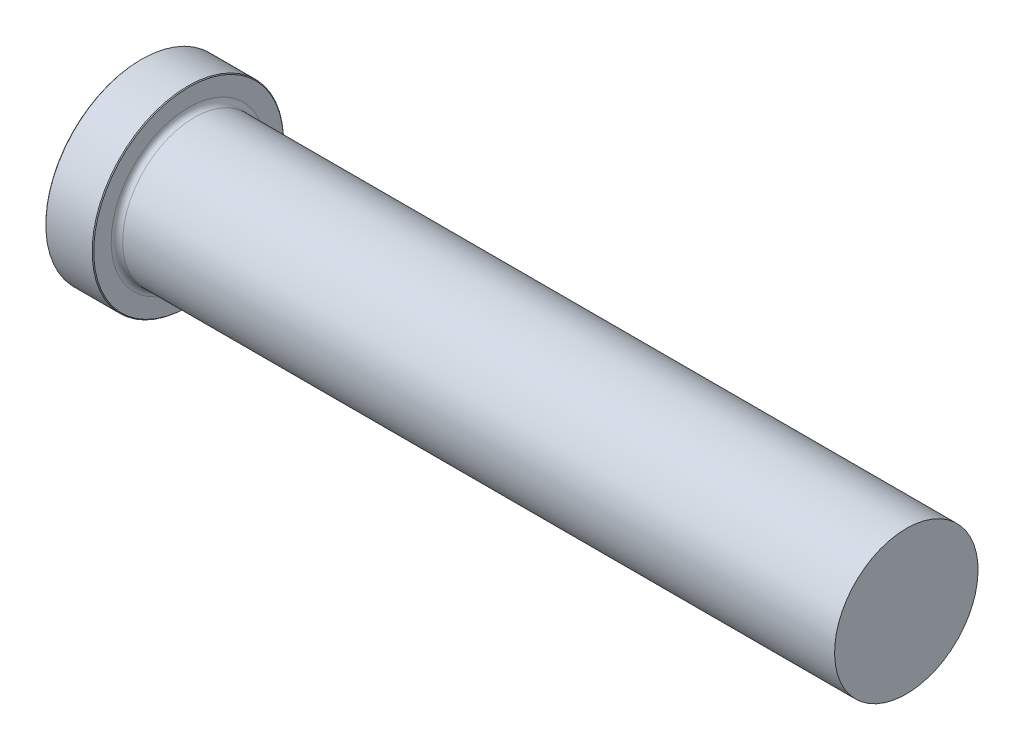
ISO-10303-21;
HEADER;
FILE_DESCRIPTION(('STEP AP214'),'2;1');
FILE_NAME('part.step','',(''),(''),'','','');
FILE_SCHEMA(('AUTOMOTIVE_DESIGN { 1 0 10303 214 1 1 1 1 }'));
ENDSEC;
DATA;
#1=APPLICATION_CONTEXT('core data for automotive mechanical design processes');
#2=APPLICATION_PROTOCOL_DEFINITION('international standard','automotive_design',2000,#1);
#3=PRODUCT_CONTEXT('',#1,'mechanical');
#4=PRODUCT('Part','Part','',(#3));
#5=PRODUCT_RELATED_PRODUCT_CATEGORY('part','',(#4));
#6=PRODUCT_DEFINITION_FORMATION('','',#4);
#7=PRODUCT_DEFINITION_CONTEXT('part definition',#1,'design');
#8=PRODUCT_DEFINITION('design','',#6,#7);
#9=PRODUCT_DEFINITION_SHAPE('','',#8);
#10=(LENGTH_UNIT() NAMED_UNIT(*) SI_UNIT(.MILLI.,.METRE.));
#11=(NAMED_UNIT(*) PLANE_ANGLE_UNIT() SI_UNIT($,.RADIAN.));
#12=(NAMED_UNIT(*) SI_UNIT($,.STERADIAN.) SOLID_ANGLE_UNIT());
#13=UNCERTAINTY_MEASURE_WITH_UNIT(LENGTH_MEASURE(1.E-05),#10,'distance_accuracy_value','');
#14=(GEOMETRIC_REPRESENTATION_CONTEXT(3) GLOBAL_UNCERTAINTY_ASSIGNED_CONTEXT((#13)) GLOBAL_UNIT_ASSIGNED_CONTEXT((#10,
#11,#12)) REPRESENTATION_CONTEXT('',''));
#15=CARTESIAN_POINT('',(0.,0.,0.));
#16=DIRECTION('',(0.,0.,1.));
#17=DIRECTION('',(1.,0.,0.));
#18=AXIS2_PLACEMENT_3D('',#15,#16,#17);
#19=CARTESIAN_POINT('',(101.6,9.51865,0.));
#20=DIRECTION('',(1.,0.,0.));
#21=DIRECTION('',(0.,1.,0.));
#22=AXIS2_PLACEMENT_3D('',#19,#20,#21);
#23=PLANE('',#22);
#24=CARTESIAN_POINT('',(101.6,0.,0.));
#25=DIRECTION('',(1.,0.,0.));
#26=DIRECTION('',(0.,1.,0.));
#27=AXIS2_PLACEMENT_3D('',#24,#25,#26);
#28=CIRCLE('',#27,9.51865);
#29=CARTESIAN_POINT('',(101.6,9.51865,0.));
#30=VERTEX_POINT('',#29);
#31=EDGE_CURVE('E50',#30,#30,#28,.T.);
#32=ORIENTED_EDGE('',*,*,#31,.T.);
#33=EDGE_LOOP('',(#32));
#34=FACE_BOUND('',#33,.T.);
#35=ADVANCED_FACE('F30',(#34),#23,.T.);
#36=CARTESIAN_POINT('',(101.6,0.,0.));
#37=DIRECTION('',(1.,0.,0.));
#38=DIRECTION('',(0.,1.,0.));
#39=AXIS2_PLACEMENT_3D('',#36,#37,#38);
#40=CYLINDRICAL_SURFACE('',#39,9.51865);
#41=CARTESIAN_POINT('',(7.11199999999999,0.,0.));
#42=DIRECTION('',(1.,0.,0.));
#43=DIRECTION('',(0.,1.,0.));
#44=AXIS2_PLACEMENT_3D('',#41,#42,#43);
#45=CIRCLE('',#44,9.51865);
#46=CARTESIAN_POINT('',(7.11199999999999,9.51865,0.));
#47=VERTEX_POINT('',#46);
#48=EDGE_CURVE('E53',#47,#47,#45,.T.);
#49=ORIENTED_EDGE('',*,*,#48,.T.);
#50=EDGE_LOOP('',(#49));
#51=FACE_BOUND('',#50,.T.);
#52=ORIENTED_EDGE('',*,*,#31,.F.);
#53=EDGE_LOOP('',(#52));
#54=FACE_BOUND('',#53,.T.);
#55=ADVANCED_FACE('F74',(#51,#54),#40,.T.);
#56=CARTESIAN_POINT('',(7.112,0.,0.));
#57=DIRECTION('',(1.,0.,0.));
#58=DIRECTION('',(0.,1.,0.));
#59=AXIS2_PLACEMENT_3D('',#56,#57,#58);
#60=TOROIDAL_SURFACE('',#59,10.28065,0.762);
#61=CARTESIAN_POINT('',(6.34999999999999,0.,0.));
#62=DIRECTION('',(1.,0.,0.));
#63=DIRECTION('',(0.,1.,0.));
#64=AXIS2_PLACEMENT_3D('',#61,#62,#63);
#65=CIRCLE('',#64,10.28065);
#66=CARTESIAN_POINT('',(6.35,10.28065,0.));
#67=VERTEX_POINT('',#66);
#68=EDGE_CURVE('E56',#67,#67,#65,.T.);
#69=ORIENTED_EDGE('',*,*,#68,.T.);
#70=EDGE_LOOP('',(#69));
#71=FACE_BOUND('',#70,.T.);
#72=ORIENTED_EDGE('',*,*,#48,.F.);
#73=EDGE_LOOP('',(#72));
#74=FACE_BOUND('',#73,.T.);
#75=ADVANCED_FACE('F60',(#71,#74),#60,.F.);
#76=CARTESIAN_POINT('',(6.35,12.7,0.));
#77=DIRECTION('',(1.,0.,0.));
#78=DIRECTION('',(0.,1.,0.));
#79=AXIS2_PLACEMENT_3D('',#76,#77,#78);
#80=PLANE('',#79);
#81=CARTESIAN_POINT('',(6.35,0.,0.));
#82=DIRECTION('',(1.,0.,0.));
#83=DIRECTION('',(0.,1.,0.));
#84=AXIS2_PLACEMENT_3D('',#81,#82,#83);
#85=CIRCLE('',#84,12.5984);
#86=CARTESIAN_POINT('',(6.35,12.5984,0.));
#87=VERTEX_POINT('',#86);
#88=EDGE_CURVE('E10',#87,#87,#85,.T.);
#89=ORIENTED_EDGE('',*,*,#88,.T.);
#90=EDGE_LOOP('',(#89));
#91=FACE_BOUND('',#90,.T.);
#92=ORIENTED_EDGE('',*,*,#68,.F.);
#93=EDGE_LOOP('',(#92));
#94=FACE_BOUND('',#93,.T.);
#95=ADVANCED_FACE('F63',(#91,#94),#80,.T.);
#96=CARTESIAN_POINT('',(101.6,0.,0.));
#97=DIRECTION('',(1.,0.,0.));
#98=DIRECTION('',(0.,1.,0.));
#99=AXIS2_PLACEMENT_3D('',#96,#97,#98);
#100=CYLINDRICAL_SURFACE('',#99,12.7);
#101=CARTESIAN_POINT('',(0.101599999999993,0.,0.));
#102=DIRECTION('',(-1.,0.,0.));
#103=DIRECTION('',(0.,-1.,0.));
#104=AXIS2_PLACEMENT_3D('',#101,#102,#103);
#105=CIRCLE('',#104,12.7);
#106=CARTESIAN_POINT('',(0.101599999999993,-12.7,0.));
#107=VERTEX_POINT('',#106);
#108=EDGE_CURVE('E41',#107,#107,#105,.F.);
#109=ORIENTED_EDGE('',*,*,#108,.T.);
#110=EDGE_LOOP('',(#109));
#111=FACE_BOUND('',#110,.T.);
#112=CARTESIAN_POINT('',(6.2484,0.,0.));
#113=DIRECTION('',(1.,0.,0.));
#114=DIRECTION('',(0.,1.,0.));
#115=AXIS2_PLACEMENT_3D('',#112,#113,#114);
#116=CIRCLE('',#115,12.7);
#117=CARTESIAN_POINT('',(6.2484,12.7,0.));
#118=VERTEX_POINT('',#117);
#119=EDGE_CURVE('E45',#118,#118,#116,.F.);
#120=ORIENTED_EDGE('',*,*,#119,.T.);
#121=EDGE_LOOP('',(#120));
#122=FACE_BOUND('',#121,.T.);
#123=ADVANCED_FACE('F65',(#111,#122),#100,.T.);
#124=CARTESIAN_POINT('',(0.,0.,0.));
#125=DIRECTION('',(-1.,0.,0.));
#126=DIRECTION('',(0.,-1.,0.));
#127=AXIS2_PLACEMENT_3D('',#124,#125,#126);
#128=PLANE('',#127);
#129=CARTESIAN_POINT('',(0.,0.,0.));
#130=DIRECTION('',(-1.,0.,0.));
#131=DIRECTION('',(0.,-1.,0.));
#132=AXIS2_PLACEMENT_3D('',#129,#130,#131);
#133=CIRCLE('',#132,12.5984);
#134=CARTESIAN_POINT('',(0.,-12.5984,0.));
#135=VERTEX_POINT('',#134);
#136=EDGE_CURVE('E37',#135,#135,#133,.T.);
#137=ORIENTED_EDGE('',*,*,#136,.T.);
#138=EDGE_LOOP('',(#137));
#139=FACE_BOUND('',#138,.T.);
#140=ADVANCED_FACE('F71',(#139),#128,.T.);
#141=CARTESIAN_POINT('',(0.101599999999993,0.,0.));
#142=DIRECTION('',(1.,0.,0.));
#143=DIRECTION('',(0.,1.,0.));
#144=AXIS2_PLACEMENT_3D('',#141,#142,#143);
#145=CONICAL_SURFACE('',#144,12.7,0.785398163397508);
#146=ORIENTED_EDGE('',*,*,#136,.F.);
#147=EDGE_LOOP('',(#146));
#148=FACE_BOUND('',#147,.T.);
#149=ORIENTED_EDGE('',*,*,#108,.F.);
#150=EDGE_LOOP('',(#149));
#151=FACE_BOUND('',#150,.T.);
#152=ADVANCED_FACE('F84',(#148,#151),#145,.T.);
#153=CARTESIAN_POINT('',(6.34999999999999,0.,0.));
#154=DIRECTION('',(-1.,0.,0.));
#155=DIRECTION('',(0.,-1.,0.));
#156=AXIS2_PLACEMENT_3D('',#153,#154,#155);
#157=CONICAL_SURFACE('',#156,12.5984,0.7853981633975);
#158=ORIENTED_EDGE('',*,*,#119,.F.);
#159=EDGE_LOOP('',(#158));
#160=FACE_BOUND('',#159,.T.);
#161=ORIENTED_EDGE('',*,*,#88,.F.);
#162=EDGE_LOOP('',(#161));
#163=FACE_BOUND('',#162,.T.);
#164=ADVANCED_FACE('F32',(#160,#163),#157,.T.);
#165=CLOSED_SHELL('',(#35,#55,#75,#95,#123,#140,#152,#164));
#166=MANIFOLD_SOLID_BREP('B2',#165);
#167=ADVANCED_BREP_SHAPE_REPRESENTATION('',(#18,#166),#14);
#168=SHAPE_DEFINITION_REPRESENTATION(#9,#167);
ENDSEC;
END-ISO-10303-21;
